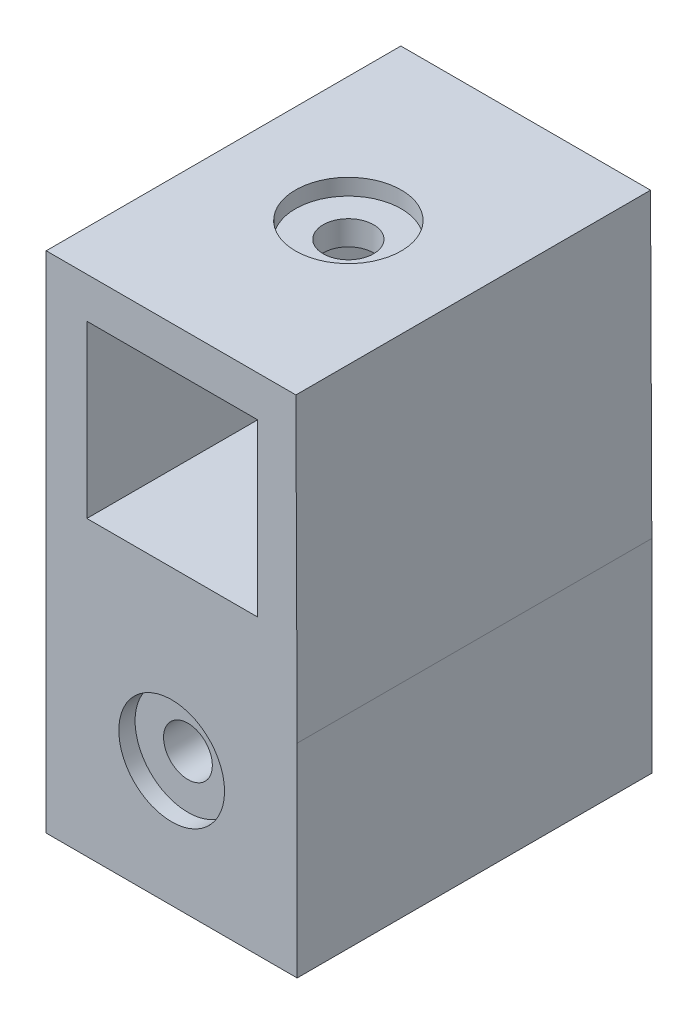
from build123d import *

# Parameters (mm, degrees)
SALIENTE_EXTRUIR1_DEPTH      = 21.8
SALIENTE_EXTRUIR1_DEPTH_BACK = 21.8
CROQUIS5_R                   = 3.1
CORTAR_EXTRUIR3_DEPTH        = 10
CROQUIS6_R                   = 6.5
CORTAR_EXTRUIR4_DEPTH        = 2
CROQUIS7_W                   = 21
CROQUIS7_H                   = 21
CORTAR_EXTRUIR5_DEPTH        = 60
CROQUIS8_W                   = 30.853898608
CROQUIS8_H                   = 43.6
SALIENTE_EXTRUIR2_DEPTH      = 25
CROQUIS9_W                   = 21
CROQUIS9_H                   = 21
CORTAR_EXTRUIR6_DEPTH        = 27
CROQUIS12_R                  = 3
CORTAR_EXTRUIR7_DEPTH        = 27
CROQUIS13_R                  = 6.5
CORTAR_EXTRUIR8_DEPTH        = 2


with BuildPart() as part:
    # Croquis1 → Saliente-Extruir1 (new, two sides: drawn at the far end of the back side and taken through both)
    with BuildSketch(Plane.XY.offset(-SALIENTE_EXTRUIR1_DEPTH_BACK)):
        Polygon((-30.989332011, -16.758305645), (-5.135433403, -16.758305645), (-0.135433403, -16.758305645), (-0.137534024, -16.258306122), (-0.288534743, 19.683577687), (-0.290879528, 20.241694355), (-6.290879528, 20.241694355), (-30.989332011, 20.241694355), align=None)
    extrude(amount=SALIENTE_EXTRUIR1_DEPTH + SALIENTE_EXTRUIR1_DEPTH_BACK)

    # Croquis5 → Cortar-Extruir3 (cut)
    with BuildSketch(Plane(origin=(0, 20.241694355, 0), x_dir=(1, 0, 0), z_dir=(0, 1, 0))):
        with Locations(Location((-15.64010577, 0, 0), (0, 0, 270))):
            Circle(CROQUIS5_R)
    extrude(amount=-CORTAR_EXTRUIR3_DEPTH, mode=Mode.SUBTRACT)

    # Croquis6 → Cortar-Extruir4 (cut)
    with BuildSketch(Plane(origin=(0, 20.241694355, 0), x_dir=(1, 0, 0), z_dir=(0, 1, 0))):
        with Locations(Location((-15.64010577, 0, 0), (0, 0, 270))):
            Circle(CROQUIS6_R)
    extrude(amount=-CORTAR_EXTRUIR4_DEPTH, mode=Mode.SUBTRACT)

    # Croquis7 → Cortar-Extruir5 (cut)
    with BuildSketch(Plane.XY.offset(21.8)):
        with Locations((-15.489332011, 4.741694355)):
            Rectangle(CROQUIS7_W, CROQUIS7_H)
    extrude(amount=-CORTAR_EXTRUIR5_DEPTH, mode=Mode.SUBTRACT)

    # Croquis8 → Saliente-Extruir2 (add)
    with BuildSketch(Plane.XZ.offset(16.758305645)):
        with Locations((-15.562382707, 0)):
            Rectangle(CROQUIS8_W, CROQUIS8_H)
    extrude(amount=SALIENTE_EXTRUIR2_DEPTH)

    # Croquis9 → Cortar-Extruir6 (cut)
    with BuildSketch(Plane.XZ.offset(41.758305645)):
        with Locations((-15.489332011, 0)):
            Rectangle(CROQUIS9_W, CROQUIS9_H)
    extrude(amount=-CORTAR_EXTRUIR6_DEPTH, mode=Mode.SUBTRACT)

    # Croquis12 → Cortar-Extruir7 (cut)
    with BuildSketch(Plane.XY.offset(21.8)):
        with Locations((-15.562382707, -26.344194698)):
            Circle(CROQUIS12_R)
    extrude(amount=-CORTAR_EXTRUIR7_DEPTH, mode=Mode.SUBTRACT)

    # Croquis13 → Cortar-Extruir8 (cut)
    with BuildSketch(Plane.XY.offset(21.8)):
        with Locations((-15.562382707, -26.344194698)):
            Circle(CROQUIS13_R)
    extrude(amount=-CORTAR_EXTRUIR8_DEPTH, mode=Mode.SUBTRACT)


solid = part.part
